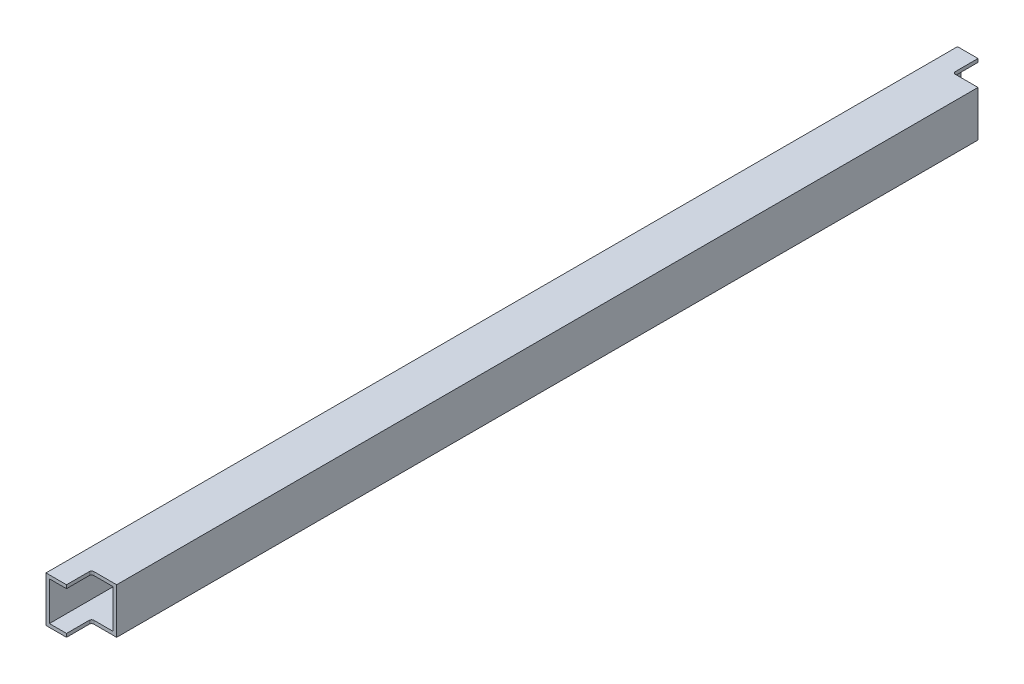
ISO-10303-21;
HEADER;
FILE_DESCRIPTION(('STEP AP214'),'2;1');
FILE_NAME('part.step','',(''),(''),'','','');
FILE_SCHEMA(('AUTOMOTIVE_DESIGN { 1 0 10303 214 1 1 1 1 }'));
ENDSEC;
DATA;
#1=APPLICATION_CONTEXT('core data for automotive mechanical design processes');
#2=APPLICATION_PROTOCOL_DEFINITION('international standard','automotive_design',2000,#1);
#3=PRODUCT_CONTEXT('',#1,'mechanical');
#4=PRODUCT('Part','Part','',(#3));
#5=PRODUCT_RELATED_PRODUCT_CATEGORY('part','',(#4));
#6=PRODUCT_DEFINITION_FORMATION('','',#4);
#7=PRODUCT_DEFINITION_CONTEXT('part definition',#1,'design');
#8=PRODUCT_DEFINITION('design','',#6,#7);
#9=PRODUCT_DEFINITION_SHAPE('','',#8);
#10=(LENGTH_UNIT() NAMED_UNIT(*) SI_UNIT(.MILLI.,.METRE.));
#11=(NAMED_UNIT(*) PLANE_ANGLE_UNIT() SI_UNIT($,.RADIAN.));
#12=(NAMED_UNIT(*) SI_UNIT($,.STERADIAN.) SOLID_ANGLE_UNIT());
#13=UNCERTAINTY_MEASURE_WITH_UNIT(LENGTH_MEASURE(1.E-05),#10,'distance_accuracy_value','');
#14=(GEOMETRIC_REPRESENTATION_CONTEXT(3) GLOBAL_UNCERTAINTY_ASSIGNED_CONTEXT((#13)) GLOBAL_UNIT_ASSIGNED_CONTEXT((#10,
#11,#12)) REPRESENTATION_CONTEXT('',''));
#15=CARTESIAN_POINT('',(0.,0.,0.));
#16=DIRECTION('',(0.,0.,1.));
#17=DIRECTION('',(1.,0.,0.));
#18=AXIS2_PLACEMENT_3D('',#15,#16,#17);
#19=CARTESIAN_POINT('',(-2.,0.,800.));
#20=DIRECTION('',(-1.,0.,0.));
#21=DIRECTION('',(0.,0.,1.));
#22=AXIS2_PLACEMENT_3D('',#19,#20,#21);
#23=PLANE('',#22);
#24=DIRECTION('',(0.,0.,-1.));
#25=VECTOR('',#24,1.);
#26=CARTESIAN_POINT('',(-2.,20.,820.));
#27=LINE('',#26,#25);
#28=CARTESIAN_POINT('',(-2.,20.,800.));
#29=VERTEX_POINT('',#28);
#30=CARTESIAN_POINT('',(-2.,20.,780.));
#31=VERTEX_POINT('',#30);
#32=EDGE_CURVE('E195',#29,#31,#27,.T.);
#33=ORIENTED_EDGE('',*,*,#32,.F.);
#34=DIRECTION('',(0.,-1.,0.));
#35=VECTOR('',#34,1.);
#36=CARTESIAN_POINT('',(-2.,0.,800.));
#37=LINE('',#36,#35);
#38=CARTESIAN_POINT('',(-2.,17.,800.));
#39=VERTEX_POINT('',#38);
#40=EDGE_CURVE('E288',#29,#39,#37,.T.);
#41=ORIENTED_EDGE('',*,*,#40,.T.);
#42=DIRECTION('',(0.,0.,-1.));
#43=VECTOR('',#42,1.);
#44=CARTESIAN_POINT('',(-2.,17.,400.));
#45=LINE('',#44,#43);
#46=CARTESIAN_POINT('',(-2.,17.,780.));
#47=VERTEX_POINT('',#46);
#48=EDGE_CURVE('E197',#39,#47,#45,.T.);
#49=ORIENTED_EDGE('',*,*,#48,.T.);
#50=DIRECTION('',(0.,-1.,0.));
#51=VECTOR('',#50,1.);
#52=CARTESIAN_POINT('',(-2.,20.,780.));
#53=LINE('',#52,#51);
#54=EDGE_CURVE('E10',#31,#47,#53,.T.);
#55=ORIENTED_EDGE('',*,*,#54,.F.);
#56=EDGE_LOOP('',(#33,#41,#49,#55));
#57=FACE_BOUND('',#56,.T.);
#58=ADVANCED_FACE('F16',(#57),#23,.F.);
#59=CARTESIAN_POINT('',(2.273736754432E-13,20.,780.));
#60=DIRECTION('',(0.,-1.,0.));
#61=DIRECTION('',(1.,0.,0.));
#62=AXIS2_PLACEMENT_3D('',#59,#60,#61);
#63=CYLINDRICAL_SURFACE('',#62,2.);
#64=DIRECTION('',(0.,-1.,0.));
#65=VECTOR('',#64,1.);
#66=CARTESIAN_POINT('',(2.273736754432E-13,20.,778.));
#67=LINE('',#66,#65);
#68=CARTESIAN_POINT('',(2.273736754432E-13,20.,778.));
#69=VERTEX_POINT('',#68);
#70=CARTESIAN_POINT('',(2.273736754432E-13,17.,778.));
#71=VERTEX_POINT('',#70);
#72=EDGE_CURVE('E203',#69,#71,#67,.T.);
#73=ORIENTED_EDGE('',*,*,#72,.F.);
#74=CARTESIAN_POINT('',(2.273736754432E-13,20.,780.));
#75=DIRECTION('',(0.,1.,0.));
#76=DIRECTION('',(1.,0.,0.));
#77=AXIS2_PLACEMENT_3D('',#74,#75,#76);
#78=CIRCLE('',#77,2.);
#79=EDGE_CURVE('E200',#69,#31,#78,.T.);
#80=ORIENTED_EDGE('',*,*,#79,.T.);
#81=ORIENTED_EDGE('',*,*,#54,.T.);
#82=CARTESIAN_POINT('',(2.273736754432E-13,17.,780.));
#83=DIRECTION('',(0.,-1.,0.));
#84=DIRECTION('',(1.,0.,0.));
#85=AXIS2_PLACEMENT_3D('',#82,#83,#84);
#86=CIRCLE('',#85,2.);
#87=EDGE_CURVE('E235',#47,#71,#86,.T.);
#88=ORIENTED_EDGE('',*,*,#87,.T.);
#89=EDGE_LOOP('',(#73,#80,#81,#88));
#90=FACE_BOUND('',#89,.T.);
#91=ADVANCED_FACE('F201',(#90),#63,.F.);
#92=CARTESIAN_POINT('',(17.,-17.,0.));
#93=DIRECTION('',(-1.,0.,0.));
#94=DIRECTION('',(0.,0.,1.));
#95=AXIS2_PLACEMENT_3D('',#92,#93,#94);
#96=PLANE('',#95);
#97=DIRECTION('',(0.,0.,1.));
#98=VECTOR('',#97,1.);
#99=CARTESIAN_POINT('',(17.,17.,0.));
#100=LINE('',#99,#98);
#101=CARTESIAN_POINT('',(17.,17.,22.));
#102=VERTEX_POINT('',#101);
#103=CARTESIAN_POINT('',(17.,17.,778.));
#104=VERTEX_POINT('',#103);
#105=EDGE_CURVE('E232',#102,#104,#100,.T.);
#106=ORIENTED_EDGE('',*,*,#105,.F.);
#107=DIRECTION('',(0.,-1.,0.));
#108=VECTOR('',#107,1.);
#109=CARTESIAN_POINT('',(17.,-18.5,22.));
#110=LINE('',#109,#108);
#111=CARTESIAN_POINT('',(17.,-17.,22.));
#112=VERTEX_POINT('',#111);
#113=EDGE_CURVE('E418',#102,#112,#110,.T.);
#114=ORIENTED_EDGE('',*,*,#113,.T.);
#115=DIRECTION('',(0.,0.,1.));
#116=VECTOR('',#115,1.);
#117=CARTESIAN_POINT('',(17.,-17.,0.));
#118=LINE('',#117,#116);
#119=CARTESIAN_POINT('',(17.,-17.,778.));
#120=VERTEX_POINT('',#119);
#121=EDGE_CURVE('E25',#112,#120,#118,.T.);
#122=ORIENTED_EDGE('',*,*,#121,.T.);
#123=DIRECTION('',(0.,1.,0.));
#124=VECTOR('',#123,1.);
#125=CARTESIAN_POINT('',(17.,1.5,778.));
#126=LINE('',#125,#124);
#127=EDGE_CURVE('E257',#120,#104,#126,.T.);
#128=ORIENTED_EDGE('',*,*,#127,.T.);
#129=EDGE_LOOP('',(#106,#114,#122,#128));
#130=FACE_BOUND('',#129,.T.);
#131=ADVANCED_FACE('F317',(#130),#96,.T.);
#132=CARTESIAN_POINT('',(2.273736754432E-13,-20.,20.));
#133=DIRECTION('',(0.,1.,0.));
#134=DIRECTION('',(1.,0.,0.));
#135=AXIS2_PLACEMENT_3D('',#132,#133,#134);
#136=CYLINDRICAL_SURFACE('',#135,2.);
#137=DIRECTION('',(0.,1.,0.));
#138=VECTOR('',#137,1.);
#139=CARTESIAN_POINT('',(2.273736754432E-13,-20.,22.));
#140=LINE('',#139,#138);
#141=CARTESIAN_POINT('',(2.273736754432E-13,17.,22.));
#142=VERTEX_POINT('',#141);
#143=CARTESIAN_POINT('',(2.273736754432E-13,20.,22.));
#144=VERTEX_POINT('',#143);
#145=EDGE_CURVE('E426',#142,#144,#140,.T.);
#146=ORIENTED_EDGE('',*,*,#145,.F.);
#147=CARTESIAN_POINT('',(2.273736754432E-13,17.,20.));
#148=DIRECTION('',(0.,1.,0.));
#149=DIRECTION('',(1.,0.,0.));
#150=AXIS2_PLACEMENT_3D('',#147,#148,#149);
#151=CIRCLE('',#150,2.);
#152=CARTESIAN_POINT('',(-2.,17.,20.));
#153=VERTEX_POINT('',#152);
#154=EDGE_CURVE('E229',#153,#142,#151,.T.);
#155=ORIENTED_EDGE('',*,*,#154,.F.);
#156=DIRECTION('',(0.,1.,0.));
#157=VECTOR('',#156,1.);
#158=CARTESIAN_POINT('',(-2.,-20.,20.));
#159=LINE('',#158,#157);
#160=CARTESIAN_POINT('',(-2.,20.,20.));
#161=VERTEX_POINT('',#160);
#162=EDGE_CURVE('E188',#153,#161,#159,.T.);
#163=ORIENTED_EDGE('',*,*,#162,.T.);
#164=CARTESIAN_POINT('',(2.273736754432E-13,20.,20.));
#165=DIRECTION('',(0.,-1.,0.));
#166=DIRECTION('',(1.,0.,0.));
#167=AXIS2_PLACEMENT_3D('',#164,#165,#166);
#168=CIRCLE('',#167,2.);
#169=EDGE_CURVE('E220',#144,#161,#168,.T.);
#170=ORIENTED_EDGE('',*,*,#169,.F.);
#171=EDGE_LOOP('',(#146,#155,#163,#170));
#172=FACE_BOUND('',#171,.T.);
#173=ADVANCED_FACE('F443',(#172),#136,.F.);
#174=CARTESIAN_POINT('',(-17.,-17.,0.));
#175=DIRECTION('',(0.,1.,0.));
#176=DIRECTION('',(1.,0.,0.));
#177=AXIS2_PLACEMENT_3D('',#174,#175,#176);
#178=PLANE('',#177);
#179=DIRECTION('',(1.,0.,0.));
#180=VECTOR('',#179,1.);
#181=CARTESIAN_POINT('',(-17.,-17.,0.));
#182=LINE('',#181,#180);
#183=CARTESIAN_POINT('',(-17.,-17.,0.));
#184=VERTEX_POINT('',#183);
#185=CARTESIAN_POINT('',(-2.,-17.,0.));
#186=VERTEX_POINT('',#185);
#187=EDGE_CURVE('E375',#184,#186,#182,.T.);
#188=ORIENTED_EDGE('',*,*,#187,.F.);
#189=DIRECTION('',(0.,0.,1.));
#190=VECTOR('',#189,1.);
#191=CARTESIAN_POINT('',(-17.,-17.,0.));
#192=LINE('',#191,#190);
#193=CARTESIAN_POINT('',(-17.,-17.,800.));
#194=VERTEX_POINT('',#193);
#195=EDGE_CURVE('E240',#184,#194,#192,.T.);
#196=ORIENTED_EDGE('',*,*,#195,.T.);
#197=DIRECTION('',(1.,0.,0.));
#198=VECTOR('',#197,1.);
#199=CARTESIAN_POINT('',(-17.,-17.,800.));
#200=LINE('',#199,#198);
#201=CARTESIAN_POINT('',(-2.,-17.,800.));
#202=VERTEX_POINT('',#201);
#203=EDGE_CURVE('E283',#194,#202,#200,.T.);
#204=ORIENTED_EDGE('',*,*,#203,.T.);
#205=DIRECTION('',(0.,0.,1.));
#206=VECTOR('',#205,1.);
#207=CARTESIAN_POINT('',(-2.,-17.,400.));
#208=LINE('',#207,#206);
#209=CARTESIAN_POINT('',(-2.,-17.,780.));
#210=VERTEX_POINT('',#209);
#211=EDGE_CURVE('E272',#210,#202,#208,.T.);
#212=ORIENTED_EDGE('',*,*,#211,.F.);
#213=CARTESIAN_POINT('',(2.273736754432E-13,-17.,780.));
#214=DIRECTION('',(0.,-1.,0.));
#215=DIRECTION('',(1.,0.,0.));
#216=AXIS2_PLACEMENT_3D('',#213,#214,#215);
#217=CIRCLE('',#216,2.);
#218=CARTESIAN_POINT('',(2.273736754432E-13,-17.,778.));
#219=VERTEX_POINT('',#218);
#220=EDGE_CURVE('E266',#210,#219,#217,.T.);
#221=ORIENTED_EDGE('',*,*,#220,.T.);
#222=DIRECTION('',(1.,0.,0.));
#223=VECTOR('',#222,1.);
#224=CARTESIAN_POINT('',(841.5,-17.,778.));
#225=LINE('',#224,#223);
#226=EDGE_CURVE('E260',#219,#120,#225,.T.);
#227=ORIENTED_EDGE('',*,*,#226,.T.);
#228=ORIENTED_EDGE('',*,*,#121,.F.);
#229=DIRECTION('',(-1.,0.,0.));
#230=VECTOR('',#229,1.);
#231=CARTESIAN_POINT('',(841.5,-17.,22.));
#232=LINE('',#231,#230);
#233=CARTESIAN_POINT('',(2.273736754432E-13,-17.,22.));
#234=VERTEX_POINT('',#233);
#235=EDGE_CURVE('E416',#112,#234,#232,.T.);
#236=ORIENTED_EDGE('',*,*,#235,.T.);
#237=CARTESIAN_POINT('',(2.273736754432E-13,-17.,20.));
#238=DIRECTION('',(0.,1.,0.));
#239=DIRECTION('',(1.,0.,0.));
#240=AXIS2_PLACEMENT_3D('',#237,#238,#239);
#241=CIRCLE('',#240,2.);
#242=CARTESIAN_POINT('',(-2.,-17.,20.));
#243=VERTEX_POINT('',#242);
#244=EDGE_CURVE('E410',#243,#234,#241,.T.);
#245=ORIENTED_EDGE('',*,*,#244,.F.);
#246=DIRECTION('',(0.,0.,1.));
#247=VECTOR('',#246,1.);
#248=CARTESIAN_POINT('',(-2.,-17.,0.));
#249=LINE('',#248,#247);
#250=EDGE_CURVE('E392',#186,#243,#249,.T.);
#251=ORIENTED_EDGE('',*,*,#250,.F.);
#252=EDGE_LOOP('',(#188,#196,#204,#212,#221,#227,#228,#236,#245,#251));
#253=FACE_BOUND('',#252,.T.);
#254=ADVANCED_FACE('F469',(#253),#178,.T.);
#255=CARTESIAN_POINT('',(-17.,17.,0.));
#256=DIRECTION('',(1.,0.,0.));
#257=DIRECTION('',(0.,1.,0.));
#258=AXIS2_PLACEMENT_3D('',#255,#256,#257);
#259=PLANE('',#258);
#260=DIRECTION('',(0.,0.,1.));
#261=VECTOR('',#260,1.);
#262=CARTESIAN_POINT('',(-17.,17.,0.));
#263=LINE('',#262,#261);
#264=CARTESIAN_POINT('',(-17.,17.,0.));
#265=VERTEX_POINT('',#264);
#266=CARTESIAN_POINT('',(-17.,17.,800.));
#267=VERTEX_POINT('',#266);
#268=EDGE_CURVE('E238',#265,#267,#263,.T.);
#269=ORIENTED_EDGE('',*,*,#268,.T.);
#270=DIRECTION('',(0.,-1.,0.));
#271=VECTOR('',#270,1.);
#272=CARTESIAN_POINT('',(-17.,17.,800.));
#273=LINE('',#272,#271);
#274=EDGE_CURVE('E287',#267,#194,#273,.T.);
#275=ORIENTED_EDGE('',*,*,#274,.T.);
#276=ORIENTED_EDGE('',*,*,#195,.F.);
#277=DIRECTION('',(0.,-1.,0.));
#278=VECTOR('',#277,1.);
#279=CARTESIAN_POINT('',(-17.,17.,0.));
#280=LINE('',#279,#278);
#281=EDGE_CURVE('E368',#265,#184,#280,.T.);
#282=ORIENTED_EDGE('',*,*,#281,.F.);
#283=EDGE_LOOP('',(#269,#275,#276,#282));
#284=FACE_BOUND('',#283,.T.);
#285=ADVANCED_FACE('F466',(#284),#259,.T.);
#286=CARTESIAN_POINT('',(17.,17.,0.));
#287=DIRECTION('',(0.,-1.,0.));
#288=DIRECTION('',(0.,0.,-1.));
#289=AXIS2_PLACEMENT_3D('',#286,#287,#288);
#290=PLANE('',#289);
#291=ORIENTED_EDGE('',*,*,#154,.T.);
#292=DIRECTION('',(1.,0.,0.));
#293=VECTOR('',#292,1.);
#294=CARTESIAN_POINT('',(858.5,17.,22.));
#295=LINE('',#294,#293);
#296=EDGE_CURVE('E421',#142,#102,#295,.T.);
#297=ORIENTED_EDGE('',*,*,#296,.T.);
#298=ORIENTED_EDGE('',*,*,#105,.T.);
#299=DIRECTION('',(-1.,0.,0.));
#300=VECTOR('',#299,1.);
#301=CARTESIAN_POINT('',(858.5,17.,778.));
#302=LINE('',#301,#300);
#303=EDGE_CURVE('E309',#104,#71,#302,.T.);
#304=ORIENTED_EDGE('',*,*,#303,.T.);
#305=ORIENTED_EDGE('',*,*,#87,.F.);
#306=ORIENTED_EDGE('',*,*,#48,.F.);
#307=DIRECTION('',(-1.,0.,0.));
#308=VECTOR('',#307,1.);
#309=CARTESIAN_POINT('',(17.,17.,800.));
#310=LINE('',#309,#308);
#311=EDGE_CURVE('E290',#39,#267,#310,.T.);
#312=ORIENTED_EDGE('',*,*,#311,.T.);
#313=ORIENTED_EDGE('',*,*,#268,.F.);
#314=DIRECTION('',(-1.,0.,0.));
#315=VECTOR('',#314,1.);
#316=CARTESIAN_POINT('',(17.,17.,0.));
#317=LINE('',#316,#315);
#318=CARTESIAN_POINT('',(-2.,17.,0.));
#319=VERTEX_POINT('',#318);
#320=EDGE_CURVE('E364',#319,#265,#317,.T.);
#321=ORIENTED_EDGE('',*,*,#320,.F.);
#322=DIRECTION('',(0.,0.,-1.));
#323=VECTOR('',#322,1.);
#324=CARTESIAN_POINT('',(-2.,17.,0.));
#325=LINE('',#324,#323);
#326=EDGE_CURVE('E226',#153,#319,#325,.T.);
#327=ORIENTED_EDGE('',*,*,#326,.F.);
#328=EDGE_LOOP('',(#291,#297,#298,#304,#305,#306,#312,#313,#321,#327));
#329=FACE_BOUND('',#328,.T.);
#330=ADVANCED_FACE('F447',(#329),#290,.T.);
#331=CARTESIAN_POINT('',(-2.,0.,0.));
#332=DIRECTION('',(-1.,0.,0.));
#333=DIRECTION('',(0.,0.,1.));
#334=AXIS2_PLACEMENT_3D('',#331,#332,#333);
#335=PLANE('',#334);
#336=ORIENTED_EDGE('',*,*,#162,.F.);
#337=ORIENTED_EDGE('',*,*,#326,.T.);
#338=DIRECTION('',(0.,-1.,0.));
#339=VECTOR('',#338,1.);
#340=CARTESIAN_POINT('',(-2.,0.,0.));
#341=LINE('',#340,#339);
#342=CARTESIAN_POINT('',(-2.,20.,0.));
#343=VERTEX_POINT('',#342);
#344=EDGE_CURVE('E354',#343,#319,#341,.T.);
#345=ORIENTED_EDGE('',*,*,#344,.F.);
#346=DIRECTION('',(0.,0.,-1.));
#347=VECTOR('',#346,1.);
#348=CARTESIAN_POINT('',(-2.,20.,20.));
#349=LINE('',#348,#347);
#350=EDGE_CURVE('E214',#161,#343,#349,.T.);
#351=ORIENTED_EDGE('',*,*,#350,.F.);
#352=EDGE_LOOP('',(#336,#337,#345,#351));
#353=FACE_BOUND('',#352,.T.);
#354=ADVANCED_FACE('F450',(#353),#335,.F.);
#355=CARTESIAN_POINT('',(20.,20.,0.));
#356=DIRECTION('',(0.,-1.,0.));
#357=DIRECTION('',(0.,0.,-1.));
#358=AXIS2_PLACEMENT_3D('',#355,#356,#357);
#359=PLANE('',#358);
#360=ORIENTED_EDGE('',*,*,#169,.T.);
#361=ORIENTED_EDGE('',*,*,#350,.T.);
#362=DIRECTION('',(-1.,0.,0.));
#363=VECTOR('',#362,1.);
#364=CARTESIAN_POINT('',(20.,20.,0.));
#365=LINE('',#364,#363);
#366=CARTESIAN_POINT('',(-20.,20.,0.));
#367=VERTEX_POINT('',#366);
#368=EDGE_CURVE('E350',#343,#367,#365,.T.);
#369=ORIENTED_EDGE('',*,*,#368,.T.);
#370=DIRECTION('',(0.,0.,1.));
#371=VECTOR('',#370,1.);
#372=CARTESIAN_POINT('',(-20.,20.,0.));
#373=LINE('',#372,#371);
#374=CARTESIAN_POINT('',(-20.,20.,800.));
#375=VERTEX_POINT('',#374);
#376=EDGE_CURVE('E273',#367,#375,#373,.T.);
#377=ORIENTED_EDGE('',*,*,#376,.T.);
#378=DIRECTION('',(-1.,0.,0.));
#379=VECTOR('',#378,1.);
#380=CARTESIAN_POINT('',(20.,20.,800.));
#381=LINE('',#380,#379);
#382=EDGE_CURVE('E211',#29,#375,#381,.T.);
#383=ORIENTED_EDGE('',*,*,#382,.F.);
#384=ORIENTED_EDGE('',*,*,#32,.T.);
#385=ORIENTED_EDGE('',*,*,#79,.F.);
#386=DIRECTION('',(-1.,0.,0.));
#387=VECTOR('',#386,1.);
#388=CARTESIAN_POINT('',(1700.,20.,778.));
#389=LINE('',#388,#387);
#390=CARTESIAN_POINT('',(20.,20.,778.));
#391=VERTEX_POINT('',#390);
#392=EDGE_CURVE('E310',#391,#69,#389,.T.);
#393=ORIENTED_EDGE('',*,*,#392,.F.);
#394=DIRECTION('',(0.,0.,1.));
#395=VECTOR('',#394,1.);
#396=CARTESIAN_POINT('',(20.,20.,0.));
#397=LINE('',#396,#395);
#398=CARTESIAN_POINT('',(20.,20.,22.));
#399=VERTEX_POINT('',#398);
#400=EDGE_CURVE('E326',#399,#391,#397,.T.);
#401=ORIENTED_EDGE('',*,*,#400,.F.);
#402=DIRECTION('',(-1.,0.,0.));
#403=VECTOR('',#402,1.);
#404=CARTESIAN_POINT('',(1700.,20.,22.));
#405=LINE('',#404,#403);
#406=EDGE_CURVE('E429',#399,#144,#405,.T.);
#407=ORIENTED_EDGE('',*,*,#406,.T.);
#408=EDGE_LOOP('',(#360,#361,#369,#377,#383,#384,#385,#393,#401,#407));
#409=FACE_BOUND('',#408,.T.);
#410=ADVANCED_FACE('F209',(#409),#359,.F.);
#411=CARTESIAN_POINT('',(-20.,20.,0.));
#412=DIRECTION('',(1.,0.,0.));
#413=DIRECTION('',(0.,1.,0.));
#414=AXIS2_PLACEMENT_3D('',#411,#412,#413);
#415=PLANE('',#414);
#416=DIRECTION('',(0.,-1.,0.));
#417=VECTOR('',#416,1.);
#418=CARTESIAN_POINT('',(-20.,20.,0.));
#419=LINE('',#418,#417);
#420=CARTESIAN_POINT('',(-20.,-20.,0.));
#421=VERTEX_POINT('',#420);
#422=EDGE_CURVE('E397',#367,#421,#419,.T.);
#423=ORIENTED_EDGE('',*,*,#422,.T.);
#424=DIRECTION('',(0.,0.,1.));
#425=VECTOR('',#424,1.);
#426=CARTESIAN_POINT('',(-20.,-20.,0.));
#427=LINE('',#426,#425);
#428=CARTESIAN_POINT('',(-20.,-20.,800.));
#429=VERTEX_POINT('',#428);
#430=EDGE_CURVE('E340',#421,#429,#427,.T.);
#431=ORIENTED_EDGE('',*,*,#430,.T.);
#432=DIRECTION('',(0.,-1.,0.));
#433=VECTOR('',#432,1.);
#434=CARTESIAN_POINT('',(-20.,20.,800.));
#435=LINE('',#434,#433);
#436=EDGE_CURVE('E280',#375,#429,#435,.T.);
#437=ORIENTED_EDGE('',*,*,#436,.F.);
#438=ORIENTED_EDGE('',*,*,#376,.F.);
#439=EDGE_LOOP('',(#423,#431,#437,#438));
#440=FACE_BOUND('',#439,.T.);
#441=ADVANCED_FACE('F458',(#440),#415,.F.);
#442=CARTESIAN_POINT('',(0.,0.,800.));
#443=DIRECTION('',(0.,0.,1.));
#444=DIRECTION('',(1.,0.,0.));
#445=AXIS2_PLACEMENT_3D('',#442,#443,#444);
#446=PLANE('',#445);
#447=ORIENTED_EDGE('',*,*,#436,.T.);
#448=DIRECTION('',(1.,0.,0.));
#449=VECTOR('',#448,1.);
#450=CARTESIAN_POINT('',(-20.,-20.,800.));
#451=LINE('',#450,#449);
#452=CARTESIAN_POINT('',(-2.,-20.,800.));
#453=VERTEX_POINT('',#452);
#454=EDGE_CURVE('E345',#429,#453,#451,.T.);
#455=ORIENTED_EDGE('',*,*,#454,.T.);
#456=DIRECTION('',(0.,-1.,0.));
#457=VECTOR('',#456,1.);
#458=CARTESIAN_POINT('',(-2.,0.,800.));
#459=LINE('',#458,#457);
#460=EDGE_CURVE('E279',#202,#453,#459,.T.);
#461=ORIENTED_EDGE('',*,*,#460,.F.);
#462=ORIENTED_EDGE('',*,*,#203,.F.);
#463=ORIENTED_EDGE('',*,*,#274,.F.);
#464=ORIENTED_EDGE('',*,*,#311,.F.);
#465=ORIENTED_EDGE('',*,*,#40,.F.);
#466=ORIENTED_EDGE('',*,*,#382,.T.);
#467=EDGE_LOOP('',(#447,#455,#461,#462,#463,#464,#465,#466));
#468=FACE_BOUND('',#467,.T.);
#469=ADVANCED_FACE('F462',(#468),#446,.T.);
#470=CARTESIAN_POINT('',(-2.,0.,800.));
#471=DIRECTION('',(-1.,0.,0.));
#472=DIRECTION('',(0.,0.,1.));
#473=AXIS2_PLACEMENT_3D('',#470,#471,#472);
#474=PLANE('',#473);
#475=ORIENTED_EDGE('',*,*,#211,.T.);
#476=ORIENTED_EDGE('',*,*,#460,.T.);
#477=DIRECTION('',(0.,0.,1.));
#478=VECTOR('',#477,1.);
#479=CARTESIAN_POINT('',(-2.,-20.,780.));
#480=LINE('',#479,#478);
#481=CARTESIAN_POINT('',(-2.,-20.,780.));
#482=VERTEX_POINT('',#481);
#483=EDGE_CURVE('E355',#482,#453,#480,.T.);
#484=ORIENTED_EDGE('',*,*,#483,.F.);
#485=DIRECTION('',(0.,-1.,0.));
#486=VECTOR('',#485,1.);
#487=CARTESIAN_POINT('',(-2.,20.,780.));
#488=LINE('',#487,#486);
#489=EDGE_CURVE('E269',#210,#482,#488,.T.);
#490=ORIENTED_EDGE('',*,*,#489,.F.);
#491=EDGE_LOOP('',(#475,#476,#484,#490));
#492=FACE_BOUND('',#491,.T.);
#493=ADVANCED_FACE('F483',(#492),#474,.F.);
#494=CARTESIAN_POINT('',(2.273736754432E-13,20.,780.));
#495=DIRECTION('',(0.,-1.,0.));
#496=DIRECTION('',(1.,0.,0.));
#497=AXIS2_PLACEMENT_3D('',#494,#495,#496);
#498=CYLINDRICAL_SURFACE('',#497,2.);
#499=DIRECTION('',(0.,-1.,0.));
#500=VECTOR('',#499,1.);
#501=CARTESIAN_POINT('',(2.273736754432E-13,20.,778.));
#502=LINE('',#501,#500);
#503=CARTESIAN_POINT('',(2.273736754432E-13,-20.,778.));
#504=VERTEX_POINT('',#503);
#505=EDGE_CURVE('E263',#219,#504,#502,.T.);
#506=ORIENTED_EDGE('',*,*,#505,.F.);
#507=ORIENTED_EDGE('',*,*,#220,.F.);
#508=ORIENTED_EDGE('',*,*,#489,.T.);
#509=CARTESIAN_POINT('',(2.273736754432E-13,-20.,780.));
#510=DIRECTION('',(0.,1.,0.));
#511=DIRECTION('',(1.,0.,0.));
#512=AXIS2_PLACEMENT_3D('',#509,#510,#511);
#513=CIRCLE('',#512,2.);
#514=EDGE_CURVE('E359',#504,#482,#513,.T.);
#515=ORIENTED_EDGE('',*,*,#514,.F.);
#516=EDGE_LOOP('',(#506,#507,#508,#515));
#517=FACE_BOUND('',#516,.T.);
#518=ADVANCED_FACE('F487',(#517),#498,.F.);
#519=CARTESIAN_POINT('',(1700.,20.,778.));
#520=DIRECTION('',(0.,0.,1.));
#521=DIRECTION('',(1.,0.,0.));
#522=AXIS2_PLACEMENT_3D('',#519,#520,#521);
#523=PLANE('',#522);
#524=DIRECTION('',(0.,1.,0.));
#525=VECTOR('',#524,1.);
#526=CARTESIAN_POINT('',(20.,0.,778.));
#527=LINE('',#526,#525);
#528=CARTESIAN_POINT('',(20.,-20.,778.));
#529=VERTEX_POINT('',#528);
#530=EDGE_CURVE('E307',#529,#391,#527,.T.);
#531=ORIENTED_EDGE('',*,*,#530,.T.);
#532=ORIENTED_EDGE('',*,*,#392,.T.);
#533=ORIENTED_EDGE('',*,*,#72,.T.);
#534=ORIENTED_EDGE('',*,*,#303,.F.);
#535=ORIENTED_EDGE('',*,*,#127,.F.);
#536=ORIENTED_EDGE('',*,*,#226,.F.);
#537=ORIENTED_EDGE('',*,*,#505,.T.);
#538=DIRECTION('',(-1.,0.,0.));
#539=VECTOR('',#538,1.);
#540=CARTESIAN_POINT('',(1700.,-20.,778.));
#541=LINE('',#540,#539);
#542=EDGE_CURVE('E363',#529,#504,#541,.T.);
#543=ORIENTED_EDGE('',*,*,#542,.F.);
#544=EDGE_LOOP('',(#531,#532,#533,#534,#535,#536,#537,#543));
#545=FACE_BOUND('',#544,.T.);
#546=ADVANCED_FACE('F322',(#545),#523,.T.);
#547=CARTESIAN_POINT('',(20.,-20.,0.));
#548=DIRECTION('',(-1.,0.,0.));
#549=DIRECTION('',(0.,0.,1.));
#550=AXIS2_PLACEMENT_3D('',#547,#548,#549);
#551=PLANE('',#550);
#552=ORIENTED_EDGE('',*,*,#530,.F.);
#553=DIRECTION('',(0.,0.,1.));
#554=VECTOR('',#553,1.);
#555=CARTESIAN_POINT('',(20.,-20.,0.));
#556=LINE('',#555,#554);
#557=CARTESIAN_POINT('',(20.,-20.,22.));
#558=VERTEX_POINT('',#557);
#559=EDGE_CURVE('E349',#558,#529,#556,.T.);
#560=ORIENTED_EDGE('',*,*,#559,.F.);
#561=DIRECTION('',(0.,-1.,0.));
#562=VECTOR('',#561,1.);
#563=CARTESIAN_POINT('',(20.,-20.,22.));
#564=LINE('',#563,#562);
#565=EDGE_CURVE('E413',#399,#558,#564,.T.);
#566=ORIENTED_EDGE('',*,*,#565,.F.);
#567=ORIENTED_EDGE('',*,*,#400,.T.);
#568=EDGE_LOOP('',(#552,#560,#566,#567));
#569=FACE_BOUND('',#568,.T.);
#570=ADVANCED_FACE('F490',(#569),#551,.F.);
#571=CARTESIAN_POINT('',(1700.,-20.,22.));
#572=DIRECTION('',(0.,0.,-1.));
#573=DIRECTION('',(0.,-1.,0.));
#574=AXIS2_PLACEMENT_3D('',#571,#572,#573);
#575=PLANE('',#574);
#576=ORIENTED_EDGE('',*,*,#565,.T.);
#577=DIRECTION('',(-1.,0.,0.));
#578=VECTOR('',#577,1.);
#579=CARTESIAN_POINT('',(1700.,-20.,22.));
#580=LINE('',#579,#578);
#581=CARTESIAN_POINT('',(2.273736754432E-13,-20.,22.));
#582=VERTEX_POINT('',#581);
#583=EDGE_CURVE('E339',#558,#582,#580,.T.);
#584=ORIENTED_EDGE('',*,*,#583,.T.);
#585=DIRECTION('',(0.,1.,0.));
#586=VECTOR('',#585,1.);
#587=CARTESIAN_POINT('',(2.273736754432E-13,-20.,22.));
#588=LINE('',#587,#586);
#589=EDGE_CURVE('E406',#582,#234,#588,.T.);
#590=ORIENTED_EDGE('',*,*,#589,.T.);
#591=ORIENTED_EDGE('',*,*,#235,.F.);
#592=ORIENTED_EDGE('',*,*,#113,.F.);
#593=ORIENTED_EDGE('',*,*,#296,.F.);
#594=ORIENTED_EDGE('',*,*,#145,.T.);
#595=ORIENTED_EDGE('',*,*,#406,.F.);
#596=EDGE_LOOP('',(#576,#584,#590,#591,#592,#593,#594,#595));
#597=FACE_BOUND('',#596,.T.);
#598=ADVANCED_FACE('F441',(#597),#575,.T.);
#599=CARTESIAN_POINT('',(2.273736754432E-13,-20.,20.));
#600=DIRECTION('',(0.,1.,0.));
#601=DIRECTION('',(1.,0.,0.));
#602=AXIS2_PLACEMENT_3D('',#599,#600,#601);
#603=CYLINDRICAL_SURFACE('',#602,2.);
#604=ORIENTED_EDGE('',*,*,#589,.F.);
#605=CARTESIAN_POINT('',(2.273736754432E-13,-20.,20.));
#606=DIRECTION('',(0.,-1.,0.));
#607=DIRECTION('',(1.,0.,0.));
#608=AXIS2_PLACEMENT_3D('',#605,#606,#607);
#609=CIRCLE('',#608,2.);
#610=CARTESIAN_POINT('',(-2.,-20.,20.));
#611=VERTEX_POINT('',#610);
#612=EDGE_CURVE('E336',#582,#611,#609,.T.);
#613=ORIENTED_EDGE('',*,*,#612,.T.);
#614=DIRECTION('',(0.,1.,0.));
#615=VECTOR('',#614,1.);
#616=CARTESIAN_POINT('',(-2.,-20.,20.));
#617=LINE('',#616,#615);
#618=EDGE_CURVE('E396',#611,#243,#617,.T.);
#619=ORIENTED_EDGE('',*,*,#618,.T.);
#620=ORIENTED_EDGE('',*,*,#244,.T.);
#621=EDGE_LOOP('',(#604,#613,#619,#620));
#622=FACE_BOUND('',#621,.T.);
#623=ADVANCED_FACE('F493',(#622),#603,.F.);
#624=CARTESIAN_POINT('',(-2.,0.,0.));
#625=DIRECTION('',(-1.,0.,0.));
#626=DIRECTION('',(0.,0.,1.));
#627=AXIS2_PLACEMENT_3D('',#624,#625,#626);
#628=PLANE('',#627);
#629=ORIENTED_EDGE('',*,*,#250,.T.);
#630=ORIENTED_EDGE('',*,*,#618,.F.);
#631=DIRECTION('',(0.,0.,1.));
#632=VECTOR('',#631,1.);
#633=CARTESIAN_POINT('',(-2.,-20.,-20.));
#634=LINE('',#633,#632);
#635=CARTESIAN_POINT('',(-2.,-20.,0.));
#636=VERTEX_POINT('',#635);
#637=EDGE_CURVE('E335',#636,#611,#634,.T.);
#638=ORIENTED_EDGE('',*,*,#637,.F.);
#639=DIRECTION('',(0.,-1.,0.));
#640=VECTOR('',#639,1.);
#641=CARTESIAN_POINT('',(-2.,0.,0.));
#642=LINE('',#641,#640);
#643=EDGE_CURVE('E379',#186,#636,#642,.T.);
#644=ORIENTED_EDGE('',*,*,#643,.F.);
#645=EDGE_LOOP('',(#629,#630,#638,#644));
#646=FACE_BOUND('',#645,.T.);
#647=ADVANCED_FACE('F472',(#646),#628,.F.);
#648=CARTESIAN_POINT('',(0.,0.,0.));
#649=DIRECTION('',(0.,0.,1.));
#650=DIRECTION('',(1.,0.,0.));
#651=AXIS2_PLACEMENT_3D('',#648,#649,#650);
#652=PLANE('',#651);
#653=ORIENTED_EDGE('',*,*,#368,.F.);
#654=ORIENTED_EDGE('',*,*,#344,.T.);
#655=ORIENTED_EDGE('',*,*,#320,.T.);
#656=ORIENTED_EDGE('',*,*,#281,.T.);
#657=ORIENTED_EDGE('',*,*,#187,.T.);
#658=ORIENTED_EDGE('',*,*,#643,.T.);
#659=DIRECTION('',(1.,0.,0.));
#660=VECTOR('',#659,1.);
#661=CARTESIAN_POINT('',(-20.,-20.,0.));
#662=LINE('',#661,#660);
#663=EDGE_CURVE('E344',#421,#636,#662,.T.);
#664=ORIENTED_EDGE('',*,*,#663,.F.);
#665=ORIENTED_EDGE('',*,*,#422,.F.);
#666=EDGE_LOOP('',(#653,#654,#655,#656,#657,#658,#664,#665));
#667=FACE_BOUND('',#666,.T.);
#668=ADVANCED_FACE('F454',(#667),#652,.F.);
#669=CARTESIAN_POINT('',(-20.,-20.,0.));
#670=DIRECTION('',(0.,1.,0.));
#671=DIRECTION('',(1.,0.,0.));
#672=AXIS2_PLACEMENT_3D('',#669,#670,#671);
#673=PLANE('',#672);
#674=ORIENTED_EDGE('',*,*,#637,.T.);
#675=ORIENTED_EDGE('',*,*,#612,.F.);
#676=ORIENTED_EDGE('',*,*,#583,.F.);
#677=ORIENTED_EDGE('',*,*,#559,.T.);
#678=ORIENTED_EDGE('',*,*,#542,.T.);
#679=ORIENTED_EDGE('',*,*,#514,.T.);
#680=ORIENTED_EDGE('',*,*,#483,.T.);
#681=ORIENTED_EDGE('',*,*,#454,.F.);
#682=ORIENTED_EDGE('',*,*,#430,.F.);
#683=ORIENTED_EDGE('',*,*,#663,.T.);
#684=EDGE_LOOP('',(#674,#675,#676,#677,#678,#679,#680,#681,#682,#683));
#685=FACE_BOUND('',#684,.T.);
#686=ADVANCED_FACE('F477',(#685),#673,.F.);
#687=CLOSED_SHELL('',(#58,#91,#131,#173,#254,#285,#330,#354,#410,#441,#469,#493,#518,#546,#570,
#598,#623,#647,#668,#686));
#688=MANIFOLD_SOLID_BREP('B1',#687);
#689=ADVANCED_BREP_SHAPE_REPRESENTATION('',(#18,#688),#14);
#690=SHAPE_DEFINITION_REPRESENTATION(#9,#689);
ENDSEC;
END-ISO-10303-21;
